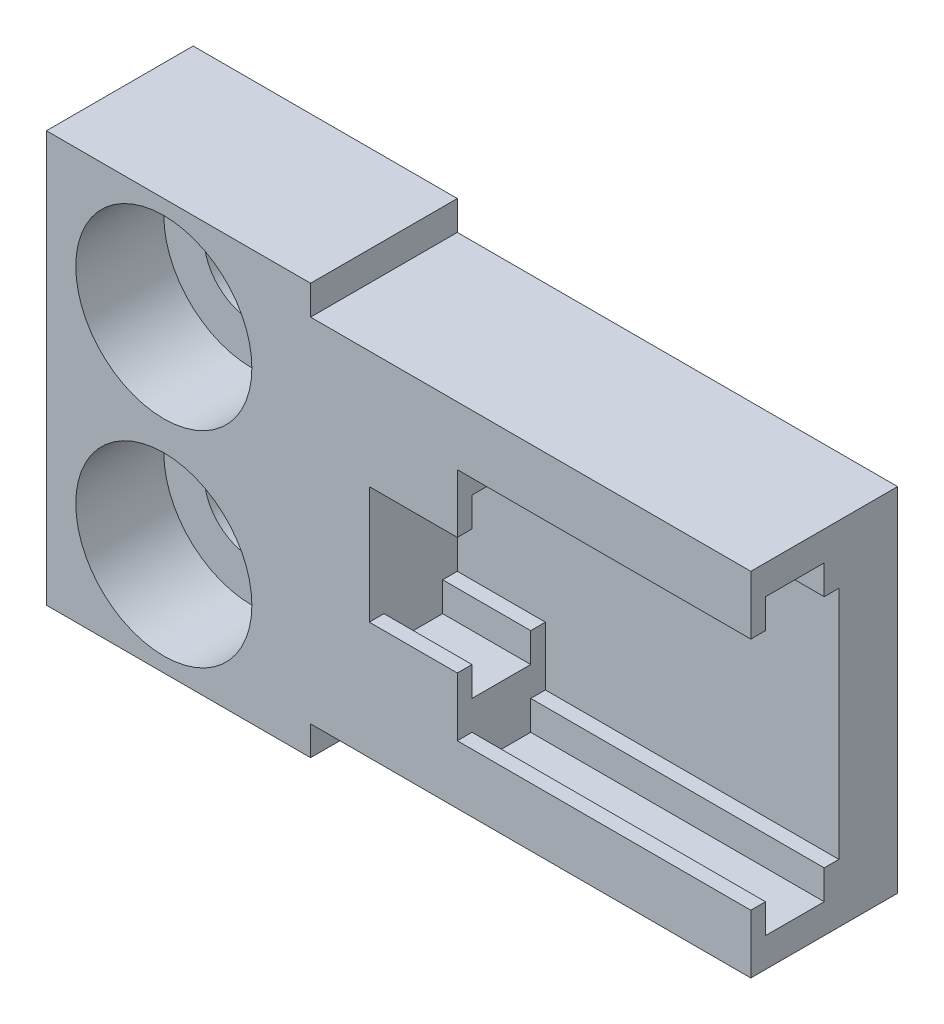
ISO-10303-21;
HEADER;
FILE_DESCRIPTION(('STEP AP214'),'2;1');
FILE_NAME('part.step','',(''),(''),'','','');
FILE_SCHEMA(('AUTOMOTIVE_DESIGN { 1 0 10303 214 1 1 1 1 }'));
ENDSEC;
DATA;
#1=APPLICATION_CONTEXT('core data for automotive mechanical design processes');
#2=APPLICATION_PROTOCOL_DEFINITION('international standard','automotive_design',2000,#1);
#3=PRODUCT_CONTEXT('',#1,'mechanical');
#4=PRODUCT('Part','Part','',(#3));
#5=PRODUCT_RELATED_PRODUCT_CATEGORY('part','',(#4));
#6=PRODUCT_DEFINITION_FORMATION('','',#4);
#7=PRODUCT_DEFINITION_CONTEXT('part definition',#1,'design');
#8=PRODUCT_DEFINITION('design','',#6,#7);
#9=PRODUCT_DEFINITION_SHAPE('','',#8);
#10=(LENGTH_UNIT() NAMED_UNIT(*) SI_UNIT(.MILLI.,.METRE.));
#11=(NAMED_UNIT(*) PLANE_ANGLE_UNIT() SI_UNIT($,.RADIAN.));
#12=(NAMED_UNIT(*) SI_UNIT($,.STERADIAN.) SOLID_ANGLE_UNIT());
#13=UNCERTAINTY_MEASURE_WITH_UNIT(LENGTH_MEASURE(1.E-05),#10,'distance_accuracy_value','');
#14=(GEOMETRIC_REPRESENTATION_CONTEXT(3) GLOBAL_UNCERTAINTY_ASSIGNED_CONTEXT((#13)) GLOBAL_UNIT_ASSIGNED_CONTEXT((#10,
#11,#12)) REPRESENTATION_CONTEXT('',''));
#15=CARTESIAN_POINT('',(0.,0.,0.));
#16=DIRECTION('',(0.,0.,1.));
#17=DIRECTION('',(1.,0.,0.));
#18=AXIS2_PLACEMENT_3D('',#15,#16,#17);
#19=CARTESIAN_POINT('',(-2.5,-2.,2.));
#20=DIRECTION('',(0.,-1.,0.));
#21=DIRECTION('',(1.,0.,0.));
#22=AXIS2_PLACEMENT_3D('',#19,#20,#21);
#23=PLANE('',#22);
#24=DIRECTION('',(0.,0.,1.));
#25=VECTOR('',#24,1.);
#26=CARTESIAN_POINT('',(-5.5,-2.,2.));
#27=LINE('',#26,#25);
#28=CARTESIAN_POINT('',(-5.5,-2.,2.));
#29=VERTEX_POINT('',#28);
#30=CARTESIAN_POINT('',(-5.5,-2.,2.5));
#31=VERTEX_POINT('',#30);
#32=EDGE_CURVE('E284',#29,#31,#27,.T.);
#33=ORIENTED_EDGE('',*,*,#32,.T.);
#34=DIRECTION('',(1.,0.,0.));
#35=VECTOR('',#34,1.);
#36=CARTESIAN_POINT('',(-5.5,-2.,2.5));
#37=LINE('',#36,#35);
#38=CARTESIAN_POINT('',(-2.5,-2.,2.5));
#39=VERTEX_POINT('',#38);
#40=EDGE_CURVE('E543',#31,#39,#37,.T.);
#41=ORIENTED_EDGE('',*,*,#40,.T.);
#42=DIRECTION('',(0.,0.,1.));
#43=VECTOR('',#42,1.);
#44=CARTESIAN_POINT('',(-2.5,-2.,2.));
#45=LINE('',#44,#43);
#46=CARTESIAN_POINT('',(-2.5,-2.,2.));
#47=VERTEX_POINT('',#46);
#48=EDGE_CURVE('E469',#47,#39,#45,.T.);
#49=ORIENTED_EDGE('',*,*,#48,.F.);
#50=DIRECTION('',(1.,0.,0.));
#51=VECTOR('',#50,1.);
#52=CARTESIAN_POINT('',(-2.5,-2.,2.));
#53=LINE('',#52,#51);
#54=EDGE_CURVE('E441',#29,#47,#53,.T.);
#55=ORIENTED_EDGE('',*,*,#54,.F.);
#56=EDGE_LOOP('',(#33,#41,#49,#55));
#57=FACE_BOUND('',#56,.T.);
#58=ADVANCED_FACE('F37',(#57),#23,.F.);
#59=CARTESIAN_POINT('',(-2.5,2.,2.));
#60=DIRECTION('',(0.,1.,0.));
#61=DIRECTION('',(-1.,0.,0.));
#62=AXIS2_PLACEMENT_3D('',#59,#60,#61);
#63=PLANE('',#62);
#64=DIRECTION('',(0.,0.,1.));
#65=VECTOR('',#64,1.);
#66=CARTESIAN_POINT('',(-5.5,2.,2.));
#67=LINE('',#66,#65);
#68=CARTESIAN_POINT('',(-5.5,2.,4.5));
#69=VERTEX_POINT('',#68);
#70=CARTESIAN_POINT('',(-5.5,2.,5.));
#71=VERTEX_POINT('',#70);
#72=EDGE_CURVE('E264',#69,#71,#67,.T.);
#73=ORIENTED_EDGE('',*,*,#72,.F.);
#74=DIRECTION('',(1.,0.,0.));
#75=VECTOR('',#74,1.);
#76=CARTESIAN_POINT('',(-5.5,2.,4.5));
#77=LINE('',#76,#75);
#78=CARTESIAN_POINT('',(-2.5,2.,4.5));
#79=VERTEX_POINT('',#78);
#80=EDGE_CURVE('E250',#69,#79,#77,.T.);
#81=ORIENTED_EDGE('',*,*,#80,.T.);
#82=DIRECTION('',(0.,0.,1.));
#83=VECTOR('',#82,1.);
#84=CARTESIAN_POINT('',(-2.5,2.,2.));
#85=LINE('',#84,#83);
#86=CARTESIAN_POINT('',(-2.5,2.,5.));
#87=VERTEX_POINT('',#86);
#88=EDGE_CURVE('E281',#79,#87,#85,.T.);
#89=ORIENTED_EDGE('',*,*,#88,.T.);
#90=DIRECTION('',(-1.,0.,0.));
#91=VECTOR('',#90,1.);
#92=CARTESIAN_POINT('',(-2.5,2.,5.));
#93=LINE('',#92,#91);
#94=EDGE_CURVE('E273',#87,#71,#93,.T.);
#95=ORIENTED_EDGE('',*,*,#94,.T.);
#96=EDGE_LOOP('',(#73,#81,#89,#95));
#97=FACE_BOUND('',#96,.T.);
#98=ADVANCED_FACE('F271',(#97),#63,.F.);
#99=CARTESIAN_POINT('',(7.5,-4.,2.));
#100=DIRECTION('',(0.,-1.,0.));
#101=DIRECTION('',(1.,0.,0.));
#102=AXIS2_PLACEMENT_3D('',#99,#100,#101);
#103=PLANE('',#102);
#104=DIRECTION('',(0.,0.,1.));
#105=VECTOR('',#104,1.);
#106=CARTESIAN_POINT('',(-2.5,-4.,2.));
#107=LINE('',#106,#105);
#108=CARTESIAN_POINT('',(-2.5,-4.,2.));
#109=VERTEX_POINT('',#108);
#110=CARTESIAN_POINT('',(-2.5,-4.,2.5));
#111=VERTEX_POINT('',#110);
#112=EDGE_CURVE('E466',#109,#111,#107,.T.);
#113=ORIENTED_EDGE('',*,*,#112,.T.);
#114=DIRECTION('',(1.,0.,0.));
#115=VECTOR('',#114,1.);
#116=CARTESIAN_POINT('',(-2.5,-4.,2.5));
#117=LINE('',#116,#115);
#118=CARTESIAN_POINT('',(7.5,-4.,2.5));
#119=VERTEX_POINT('',#118);
#120=EDGE_CURVE('E515',#111,#119,#117,.T.);
#121=ORIENTED_EDGE('',*,*,#120,.T.);
#122=DIRECTION('',(0.,0.,1.));
#123=VECTOR('',#122,1.);
#124=CARTESIAN_POINT('',(7.5,-4.,2.));
#125=LINE('',#124,#123);
#126=CARTESIAN_POINT('',(7.5,-4.,2.));
#127=VERTEX_POINT('',#126);
#128=EDGE_CURVE('E302',#127,#119,#125,.T.);
#129=ORIENTED_EDGE('',*,*,#128,.F.);
#130=DIRECTION('',(1.,0.,0.));
#131=VECTOR('',#130,1.);
#132=CARTESIAN_POINT('',(7.5,-4.,2.));
#133=LINE('',#132,#131);
#134=EDGE_CURVE('E432',#109,#127,#133,.T.);
#135=ORIENTED_EDGE('',*,*,#134,.F.);
#136=EDGE_LOOP('',(#113,#121,#129,#135));
#137=FACE_BOUND('',#136,.T.);
#138=ADVANCED_FACE('F547',(#137),#103,.F.);
#139=CARTESIAN_POINT('',(7.5,4.,2.));
#140=DIRECTION('',(0.,1.,0.));
#141=DIRECTION('',(-1.,0.,0.));
#142=AXIS2_PLACEMENT_3D('',#139,#140,#141);
#143=PLANE('',#142);
#144=DIRECTION('',(0.,0.,1.));
#145=VECTOR('',#144,1.);
#146=CARTESIAN_POINT('',(-2.5,4.,2.));
#147=LINE('',#146,#145);
#148=CARTESIAN_POINT('',(-2.5,4.,4.5));
#149=VERTEX_POINT('',#148);
#150=CARTESIAN_POINT('',(-2.5,4.,5.));
#151=VERTEX_POINT('',#150);
#152=EDGE_CURVE('E290',#149,#151,#147,.T.);
#153=ORIENTED_EDGE('',*,*,#152,.F.);
#154=DIRECTION('',(1.,0.,0.));
#155=VECTOR('',#154,1.);
#156=CARTESIAN_POINT('',(-2.5,4.,4.5));
#157=LINE('',#156,#155);
#158=CARTESIAN_POINT('',(7.5,4.,4.5));
#159=VERTEX_POINT('',#158);
#160=EDGE_CURVE('E511',#149,#159,#157,.T.);
#161=ORIENTED_EDGE('',*,*,#160,.T.);
#162=DIRECTION('',(0.,0.,1.));
#163=VECTOR('',#162,1.);
#164=CARTESIAN_POINT('',(7.5,4.,2.));
#165=LINE('',#164,#163);
#166=CARTESIAN_POINT('',(7.5,4.,5.));
#167=VERTEX_POINT('',#166);
#168=EDGE_CURVE('E294',#159,#167,#165,.T.);
#169=ORIENTED_EDGE('',*,*,#168,.T.);
#170=DIRECTION('',(-1.,0.,0.));
#171=VECTOR('',#170,1.);
#172=CARTESIAN_POINT('',(7.5,4.,5.));
#173=LINE('',#172,#171);
#174=EDGE_CURVE('E426',#167,#151,#173,.T.);
#175=ORIENTED_EDGE('',*,*,#174,.T.);
#176=EDGE_LOOP('',(#153,#161,#169,#175));
#177=FACE_BOUND('',#176,.T.);
#178=ADVANCED_FACE('F616',(#177),#143,.F.);
#179=CARTESIAN_POINT('',(7.5,-6.,5.));
#180=DIRECTION('',(-1.,0.,0.));
#181=DIRECTION('',(0.,0.,1.));
#182=AXIS2_PLACEMENT_3D('',#179,#180,#181);
#183=PLANE('',#182);
#184=ORIENTED_EDGE('',*,*,#168,.F.);
#185=DIRECTION('',(0.,-1.,0.));
#186=VECTOR('',#185,1.);
#187=CARTESIAN_POINT('',(7.5,4.,4.5));
#188=LINE('',#187,#186);
#189=CARTESIAN_POINT('',(7.5,5.,4.5));
#190=VERTEX_POINT('',#189);
#191=EDGE_CURVE('E429',#190,#159,#188,.T.);
#192=ORIENTED_EDGE('',*,*,#191,.F.);
#193=DIRECTION('',(0.,0.,1.));
#194=VECTOR('',#193,1.);
#195=CARTESIAN_POINT('',(7.5,5.,4.5));
#196=LINE('',#195,#194);
#197=CARTESIAN_POINT('',(7.5,5.,2.5));
#198=VERTEX_POINT('',#197);
#199=EDGE_CURVE('E600',#198,#190,#196,.T.);
#200=ORIENTED_EDGE('',*,*,#199,.F.);
#201=DIRECTION('',(0.,1.,0.));
#202=VECTOR('',#201,1.);
#203=CARTESIAN_POINT('',(7.5,4.,2.5));
#204=LINE('',#203,#202);
#205=CARTESIAN_POINT('',(7.5,4.,2.5));
#206=VERTEX_POINT('',#205);
#207=EDGE_CURVE('E606',#206,#198,#204,.T.);
#208=ORIENTED_EDGE('',*,*,#207,.F.);
#209=CARTESIAN_POINT('',(7.5,4.,2.));
#210=VERTEX_POINT('',#209);
#211=EDGE_CURVE('E291',#210,#206,#165,.T.);
#212=ORIENTED_EDGE('',*,*,#211,.F.);
#213=DIRECTION('',(0.,1.,0.));
#214=VECTOR('',#213,1.);
#215=CARTESIAN_POINT('',(7.5,4.,2.));
#216=LINE('',#215,#214);
#217=EDGE_CURVE('E462',#127,#210,#216,.T.);
#218=ORIENTED_EDGE('',*,*,#217,.F.);
#219=ORIENTED_EDGE('',*,*,#128,.T.);
#220=DIRECTION('',(0.,1.,0.));
#221=VECTOR('',#220,1.);
#222=CARTESIAN_POINT('',(7.5,-4.,2.5));
#223=LINE('',#222,#221);
#224=CARTESIAN_POINT('',(7.5,-5.,2.5));
#225=VERTEX_POINT('',#224);
#226=EDGE_CURVE('E519',#225,#119,#223,.T.);
#227=ORIENTED_EDGE('',*,*,#226,.F.);
#228=DIRECTION('',(0.,0.,-1.));
#229=VECTOR('',#228,1.);
#230=CARTESIAN_POINT('',(7.5,-5.,4.5));
#231=LINE('',#230,#229);
#232=CARTESIAN_POINT('',(7.5,-5.,4.5));
#233=VERTEX_POINT('',#232);
#234=EDGE_CURVE('E521',#233,#225,#231,.T.);
#235=ORIENTED_EDGE('',*,*,#234,.F.);
#236=DIRECTION('',(0.,-1.,0.));
#237=VECTOR('',#236,1.);
#238=CARTESIAN_POINT('',(7.5,-4.,4.5));
#239=LINE('',#238,#237);
#240=CARTESIAN_POINT('',(7.5,-4.,4.5));
#241=VERTEX_POINT('',#240);
#242=EDGE_CURVE('E524',#241,#233,#239,.T.);
#243=ORIENTED_EDGE('',*,*,#242,.F.);
#244=CARTESIAN_POINT('',(7.5,-4.,5.));
#245=VERTEX_POINT('',#244);
#246=EDGE_CURVE('E465',#241,#245,#125,.T.);
#247=ORIENTED_EDGE('',*,*,#246,.T.);
#248=DIRECTION('',(0.,1.,0.));
#249=VECTOR('',#248,1.);
#250=CARTESIAN_POINT('',(7.5,-6.,5.));
#251=LINE('',#250,#249);
#252=CARTESIAN_POINT('',(7.5,-6.,5.));
#253=VERTEX_POINT('',#252);
#254=EDGE_CURVE('E351',#253,#245,#251,.T.);
#255=ORIENTED_EDGE('',*,*,#254,.F.);
#256=DIRECTION('',(0.,0.,-1.));
#257=VECTOR('',#256,1.);
#258=CARTESIAN_POINT('',(7.5,-6.,5.));
#259=LINE('',#258,#257);
#260=CARTESIAN_POINT('',(7.5,-6.,0.));
#261=VERTEX_POINT('',#260);
#262=EDGE_CURVE('E359',#253,#261,#259,.T.);
#263=ORIENTED_EDGE('',*,*,#262,.T.);
#264=DIRECTION('',(0.,1.,0.));
#265=VECTOR('',#264,1.);
#266=CARTESIAN_POINT('',(7.5,-6.,0.));
#267=LINE('',#266,#265);
#268=CARTESIAN_POINT('',(7.5,6.,0.));
#269=VERTEX_POINT('',#268);
#270=EDGE_CURVE('E344',#261,#269,#267,.T.);
#271=ORIENTED_EDGE('',*,*,#270,.T.);
#272=DIRECTION('',(0.,0.,-1.));
#273=VECTOR('',#272,1.);
#274=CARTESIAN_POINT('',(7.5,6.,5.));
#275=LINE('',#274,#273);
#276=CARTESIAN_POINT('',(7.5,6.,5.));
#277=VERTEX_POINT('',#276);
#278=EDGE_CURVE('E11',#277,#269,#275,.T.);
#279=ORIENTED_EDGE('',*,*,#278,.F.);
#280=EDGE_CURVE('E355',#167,#277,#251,.T.);
#281=ORIENTED_EDGE('',*,*,#280,.F.);
#282=EDGE_LOOP('',(#184,#192,#200,#208,#212,#218,#219,#227,#235,#243,#247,#255,#263,#271,#279,#281));
#283=FACE_BOUND('',#282,.T.);
#284=ADVANCED_FACE('F39',(#283),#183,.F.);
#285=CARTESIAN_POINT('',(-7.5,6.,5.));
#286=DIRECTION('',(0.,-1.,0.));
#287=DIRECTION('',(0.,0.,-1.));
#288=AXIS2_PLACEMENT_3D('',#285,#286,#287);
#289=PLANE('',#288);
#290=DIRECTION('',(-1.,0.,0.));
#291=VECTOR('',#290,1.);
#292=CARTESIAN_POINT('',(-7.5,6.,0.));
#293=LINE('',#292,#291);
#294=CARTESIAN_POINT('',(-7.5,6.,0.));
#295=VERTEX_POINT('',#294);
#296=EDGE_CURVE('E362',#269,#295,#293,.T.);
#297=ORIENTED_EDGE('',*,*,#296,.T.);
#298=DIRECTION('',(0.,0.,-1.));
#299=VECTOR('',#298,1.);
#300=CARTESIAN_POINT('',(-7.5,6.,5.));
#301=LINE('',#300,#299);
#302=CARTESIAN_POINT('',(-7.5,6.,5.));
#303=VERTEX_POINT('',#302);
#304=EDGE_CURVE('E46',#303,#295,#301,.T.);
#305=ORIENTED_EDGE('',*,*,#304,.F.);
#306=DIRECTION('',(-1.,0.,0.));
#307=VECTOR('',#306,1.);
#308=CARTESIAN_POINT('',(-7.5,6.,5.));
#309=LINE('',#308,#307);
#310=EDGE_CURVE('E354',#277,#303,#309,.T.);
#311=ORIENTED_EDGE('',*,*,#310,.F.);
#312=ORIENTED_EDGE('',*,*,#278,.T.);
#313=EDGE_LOOP('',(#297,#305,#311,#312));
#314=FACE_BOUND('',#313,.T.);
#315=ADVANCED_FACE('F422',(#314),#289,.F.);
#316=CARTESIAN_POINT('',(-7.5,-6.,5.));
#317=DIRECTION('',(0.,1.,0.));
#318=DIRECTION('',(0.,0.,1.));
#319=AXIS2_PLACEMENT_3D('',#316,#317,#318);
#320=PLANE('',#319);
#321=DIRECTION('',(1.,0.,0.));
#322=VECTOR('',#321,1.);
#323=CARTESIAN_POINT('',(-7.5,-6.,0.));
#324=LINE('',#323,#322);
#325=CARTESIAN_POINT('',(-7.5,-6.,0.));
#326=VERTEX_POINT('',#325);
#327=EDGE_CURVE('E364',#326,#261,#324,.T.);
#328=ORIENTED_EDGE('',*,*,#327,.T.);
#329=ORIENTED_EDGE('',*,*,#262,.F.);
#330=DIRECTION('',(1.,0.,0.));
#331=VECTOR('',#330,1.);
#332=CARTESIAN_POINT('',(-7.5,-6.,5.));
#333=LINE('',#332,#331);
#334=CARTESIAN_POINT('',(-7.5,-6.,5.));
#335=VERTEX_POINT('',#334);
#336=EDGE_CURVE('E357',#335,#253,#333,.T.);
#337=ORIENTED_EDGE('',*,*,#336,.F.);
#338=DIRECTION('',(0.,0.,-1.));
#339=VECTOR('',#338,1.);
#340=CARTESIAN_POINT('',(-7.5,-6.,5.));
#341=LINE('',#340,#339);
#342=EDGE_CURVE('E368',#335,#326,#341,.T.);
#343=ORIENTED_EDGE('',*,*,#342,.T.);
#344=EDGE_LOOP('',(#328,#329,#337,#343));
#345=FACE_BOUND('',#344,.T.);
#346=ADVANCED_FACE('F397',(#345),#320,.F.);
#347=CARTESIAN_POINT('',(0.,0.,5.));
#348=DIRECTION('',(0.,0.,-1.));
#349=DIRECTION('',(-1.,0.,0.));
#350=AXIS2_PLACEMENT_3D('',#347,#348,#349);
#351=PLANE('',#350);
#352=CARTESIAN_POINT('',(-12.5002300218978,-3.50000000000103,5.));
#353=DIRECTION('',(0.,0.,1.));
#354=DIRECTION('',(1.,0.,0.));
#355=AXIS2_PLACEMENT_3D('',#352,#353,#354);
#356=CIRCLE('',#355,3.);
#357=CARTESIAN_POINT('',(-9.5002300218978,-3.50000000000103,5.));
#358=VERTEX_POINT('',#357);
#359=EDGE_CURVE('E307',#358,#358,#356,.T.);
#360=ORIENTED_EDGE('',*,*,#359,.F.);
#361=EDGE_LOOP('',(#360));
#362=FACE_BOUND('',#361,.T.);
#363=CARTESIAN_POINT('',(-12.5002300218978,3.5,5.));
#364=DIRECTION('',(0.,0.,1.));
#365=DIRECTION('',(1.,0.,0.));
#366=AXIS2_PLACEMENT_3D('',#363,#364,#365);
#367=CIRCLE('',#366,3.);
#368=CARTESIAN_POINT('',(-9.5002300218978,3.5,5.));
#369=VERTEX_POINT('',#368);
#370=EDGE_CURVE('E310',#369,#369,#367,.T.);
#371=ORIENTED_EDGE('',*,*,#370,.F.);
#372=EDGE_LOOP('',(#371));
#373=FACE_BOUND('',#372,.T.);
#374=ORIENTED_EDGE('',*,*,#254,.T.);
#375=DIRECTION('',(1.,0.,0.));
#376=VECTOR('',#375,1.);
#377=CARTESIAN_POINT('',(7.5,-4.,5.));
#378=LINE('',#377,#376);
#379=CARTESIAN_POINT('',(-2.5,-4.,5.));
#380=VERTEX_POINT('',#379);
#381=EDGE_CURVE('E459',#380,#245,#378,.T.);
#382=ORIENTED_EDGE('',*,*,#381,.F.);
#383=DIRECTION('',(0.,-1.,0.));
#384=VECTOR('',#383,1.);
#385=CARTESIAN_POINT('',(-2.5,-2.,5.));
#386=LINE('',#385,#384);
#387=CARTESIAN_POINT('',(-2.5,-2.,5.));
#388=VERTEX_POINT('',#387);
#389=EDGE_CURVE('E456',#388,#380,#386,.T.);
#390=ORIENTED_EDGE('',*,*,#389,.F.);
#391=DIRECTION('',(1.,0.,0.));
#392=VECTOR('',#391,1.);
#393=CARTESIAN_POINT('',(-2.5,-2.,5.));
#394=LINE('',#393,#392);
#395=CARTESIAN_POINT('',(-5.5,-2.,5.));
#396=VERTEX_POINT('',#395);
#397=EDGE_CURVE('E453',#396,#388,#394,.T.);
#398=ORIENTED_EDGE('',*,*,#397,.F.);
#399=DIRECTION('',(0.,-1.,0.));
#400=VECTOR('',#399,1.);
#401=CARTESIAN_POINT('',(-5.5,2.,5.));
#402=LINE('',#401,#400);
#403=EDGE_CURVE('E451',#71,#396,#402,.T.);
#404=ORIENTED_EDGE('',*,*,#403,.F.);
#405=ORIENTED_EDGE('',*,*,#94,.F.);
#406=DIRECTION('',(0.,-1.,0.));
#407=VECTOR('',#406,1.);
#408=CARTESIAN_POINT('',(-2.5,4.,5.));
#409=LINE('',#408,#407);
#410=EDGE_CURVE('E446',#151,#87,#409,.T.);
#411=ORIENTED_EDGE('',*,*,#410,.F.);
#412=ORIENTED_EDGE('',*,*,#174,.F.);
#413=ORIENTED_EDGE('',*,*,#280,.T.);
#414=ORIENTED_EDGE('',*,*,#310,.T.);
#415=DIRECTION('',(0.,-1.,0.));
#416=VECTOR('',#415,1.);
#417=CARTESIAN_POINT('',(-7.5,6.,5.));
#418=LINE('',#417,#416);
#419=CARTESIAN_POINT('',(-7.5,7.,5.));
#420=VERTEX_POINT('',#419);
#421=EDGE_CURVE('E316',#420,#303,#418,.T.);
#422=ORIENTED_EDGE('',*,*,#421,.F.);
#423=DIRECTION('',(1.,0.,0.));
#424=VECTOR('',#423,1.);
#425=CARTESIAN_POINT('',(-16.5,7.,5.));
#426=LINE('',#425,#424);
#427=CARTESIAN_POINT('',(-16.5,7.,5.));
#428=VERTEX_POINT('',#427);
#429=EDGE_CURVE('E326',#428,#420,#426,.T.);
#430=ORIENTED_EDGE('',*,*,#429,.F.);
#431=DIRECTION('',(0.,1.,0.));
#432=VECTOR('',#431,1.);
#433=CARTESIAN_POINT('',(-16.5,-7.,5.));
#434=LINE('',#433,#432);
#435=CARTESIAN_POINT('',(-16.5,-7.,5.));
#436=VERTEX_POINT('',#435);
#437=EDGE_CURVE('E323',#436,#428,#434,.T.);
#438=ORIENTED_EDGE('',*,*,#437,.F.);
#439=DIRECTION('',(-1.,0.,0.));
#440=VECTOR('',#439,1.);
#441=CARTESIAN_POINT('',(-7.5,-7.,5.));
#442=LINE('',#441,#440);
#443=CARTESIAN_POINT('',(-7.5,-7.,5.));
#444=VERTEX_POINT('',#443);
#445=EDGE_CURVE('E319',#444,#436,#442,.T.);
#446=ORIENTED_EDGE('',*,*,#445,.F.);
#447=EDGE_CURVE('E320',#335,#444,#418,.T.);
#448=ORIENTED_EDGE('',*,*,#447,.F.);
#449=ORIENTED_EDGE('',*,*,#336,.T.);
#450=EDGE_LOOP('',(#374,#382,#390,#398,#404,#405,#411,#412,#413,#414,#422,#430,#438,#446,#448,#449));
#451=FACE_BOUND('',#450,.T.);
#452=ADVANCED_FACE('F384',(#362,#373,#451),#351,.F.);
#453=CARTESIAN_POINT('',(0.,0.,0.));
#454=DIRECTION('',(0.,0.,-1.));
#455=DIRECTION('',(-1.,0.,0.));
#456=AXIS2_PLACEMENT_3D('',#453,#454,#455);
#457=PLANE('',#456);
#458=CARTESIAN_POINT('',(-12.5002300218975,-3.49999999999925,0.));
#459=DIRECTION('',(0.,0.,-1.));
#460=DIRECTION('',(-1.,0.,0.));
#461=AXIS2_PLACEMENT_3D('',#458,#459,#460);
#462=CIRCLE('',#461,1.625);
#463=CARTESIAN_POINT('',(-14.1252300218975,-3.49999999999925,0.));
#464=VERTEX_POINT('',#463);
#465=EDGE_CURVE('E41',#464,#464,#462,.T.);
#466=ORIENTED_EDGE('',*,*,#465,.F.);
#467=EDGE_LOOP('',(#466));
#468=FACE_BOUND('',#467,.T.);
#469=CARTESIAN_POINT('',(-12.5002300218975,3.5,0.));
#470=DIRECTION('',(0.,0.,-1.));
#471=DIRECTION('',(-1.,0.,0.));
#472=AXIS2_PLACEMENT_3D('',#469,#470,#471);
#473=CIRCLE('',#472,1.625);
#474=CARTESIAN_POINT('',(-14.1252300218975,3.5,0.));
#475=VERTEX_POINT('',#474);
#476=EDGE_CURVE('E298',#475,#475,#473,.T.);
#477=ORIENTED_EDGE('',*,*,#476,.F.);
#478=EDGE_LOOP('',(#477));
#479=FACE_BOUND('',#478,.T.);
#480=ORIENTED_EDGE('',*,*,#270,.F.);
#481=ORIENTED_EDGE('',*,*,#327,.F.);
#482=DIRECTION('',(0.,-1.,0.));
#483=VECTOR('',#482,1.);
#484=CARTESIAN_POINT('',(-7.5,7.,0.));
#485=LINE('',#484,#483);
#486=CARTESIAN_POINT('',(-7.5,-7.,0.));
#487=VERTEX_POINT('',#486);
#488=EDGE_CURVE('E338',#326,#487,#485,.T.);
#489=ORIENTED_EDGE('',*,*,#488,.T.);
#490=DIRECTION('',(-1.,0.,0.));
#491=VECTOR('',#490,1.);
#492=CARTESIAN_POINT('',(-7.5,-7.,0.));
#493=LINE('',#492,#491);
#494=CARTESIAN_POINT('',(-16.5,-7.,0.));
#495=VERTEX_POINT('',#494);
#496=EDGE_CURVE('E306',#487,#495,#493,.T.);
#497=ORIENTED_EDGE('',*,*,#496,.T.);
#498=DIRECTION('',(0.,1.,0.));
#499=VECTOR('',#498,1.);
#500=CARTESIAN_POINT('',(-16.5,-7.,0.));
#501=LINE('',#500,#499);
#502=CARTESIAN_POINT('',(-16.5,7.,0.));
#503=VERTEX_POINT('',#502);
#504=EDGE_CURVE('E332',#495,#503,#501,.T.);
#505=ORIENTED_EDGE('',*,*,#504,.T.);
#506=DIRECTION('',(1.,0.,0.));
#507=VECTOR('',#506,1.);
#508=CARTESIAN_POINT('',(-16.5,7.,0.));
#509=LINE('',#508,#507);
#510=CARTESIAN_POINT('',(-7.5,7.,0.));
#511=VERTEX_POINT('',#510);
#512=EDGE_CURVE('E335',#503,#511,#509,.T.);
#513=ORIENTED_EDGE('',*,*,#512,.T.);
#514=EDGE_CURVE('E339',#511,#295,#485,.T.);
#515=ORIENTED_EDGE('',*,*,#514,.T.);
#516=ORIENTED_EDGE('',*,*,#296,.F.);
#517=EDGE_LOOP('',(#480,#481,#489,#497,#505,#513,#515,#516));
#518=FACE_BOUND('',#517,.T.);
#519=ADVANCED_FACE('F380',(#468,#479,#518),#457,.T.);
#520=CARTESIAN_POINT('',(-7.5,7.,5.));
#521=DIRECTION('',(1.,0.,0.));
#522=DIRECTION('',(0.,0.,-1.));
#523=AXIS2_PLACEMENT_3D('',#520,#521,#522);
#524=PLANE('',#523);
#525=ORIENTED_EDGE('',*,*,#342,.F.);
#526=ORIENTED_EDGE('',*,*,#447,.T.);
#527=DIRECTION('',(0.,0.,-1.));
#528=VECTOR('',#527,1.);
#529=CARTESIAN_POINT('',(-7.5,-7.,5.));
#530=LINE('',#529,#528);
#531=EDGE_CURVE('E329',#444,#487,#530,.T.);
#532=ORIENTED_EDGE('',*,*,#531,.T.);
#533=ORIENTED_EDGE('',*,*,#488,.F.);
#534=EDGE_LOOP('',(#525,#526,#532,#533));
#535=FACE_BOUND('',#534,.T.);
#536=ADVANCED_FACE('F383',(#535),#524,.T.);
#537=ORIENTED_EDGE('',*,*,#421,.T.);
#538=ORIENTED_EDGE('',*,*,#304,.T.);
#539=ORIENTED_EDGE('',*,*,#514,.F.);
#540=DIRECTION('',(0.,0.,-1.));
#541=VECTOR('',#540,1.);
#542=CARTESIAN_POINT('',(-7.5,7.,5.));
#543=LINE('',#542,#541);
#544=EDGE_CURVE('E342',#420,#511,#543,.T.);
#545=ORIENTED_EDGE('',*,*,#544,.F.);
#546=EDGE_LOOP('',(#537,#538,#539,#545));
#547=FACE_BOUND('',#546,.T.);
#548=ADVANCED_FACE('F418',(#547),#524,.T.);
#549=CARTESIAN_POINT('',(-16.5,7.,5.));
#550=DIRECTION('',(0.,1.,0.));
#551=DIRECTION('',(-1.,0.,0.));
#552=AXIS2_PLACEMENT_3D('',#549,#550,#551);
#553=PLANE('',#552);
#554=ORIENTED_EDGE('',*,*,#512,.F.);
#555=DIRECTION('',(0.,0.,-1.));
#556=VECTOR('',#555,1.);
#557=CARTESIAN_POINT('',(-16.5,7.,5.));
#558=LINE('',#557,#556);
#559=EDGE_CURVE('E345',#428,#503,#558,.T.);
#560=ORIENTED_EDGE('',*,*,#559,.F.);
#561=ORIENTED_EDGE('',*,*,#429,.T.);
#562=ORIENTED_EDGE('',*,*,#544,.T.);
#563=EDGE_LOOP('',(#554,#560,#561,#562));
#564=FACE_BOUND('',#563,.T.);
#565=ADVANCED_FACE('F415',(#564),#553,.T.);
#566=CARTESIAN_POINT('',(-16.5,-7.,5.));
#567=DIRECTION('',(-1.,0.,0.));
#568=DIRECTION('',(0.,0.,1.));
#569=AXIS2_PLACEMENT_3D('',#566,#567,#568);
#570=PLANE('',#569);
#571=ORIENTED_EDGE('',*,*,#504,.F.);
#572=DIRECTION('',(0.,0.,-1.));
#573=VECTOR('',#572,1.);
#574=CARTESIAN_POINT('',(-16.5,-7.,5.));
#575=LINE('',#574,#573);
#576=EDGE_CURVE('E347',#436,#495,#575,.T.);
#577=ORIENTED_EDGE('',*,*,#576,.F.);
#578=ORIENTED_EDGE('',*,*,#437,.T.);
#579=ORIENTED_EDGE('',*,*,#559,.T.);
#580=EDGE_LOOP('',(#571,#577,#578,#579));
#581=FACE_BOUND('',#580,.T.);
#582=ADVANCED_FACE('F413',(#581),#570,.T.);
#583=CARTESIAN_POINT('',(-7.5,-7.,5.));
#584=DIRECTION('',(0.,-1.,0.));
#585=DIRECTION('',(0.,0.,-1.));
#586=AXIS2_PLACEMENT_3D('',#583,#584,#585);
#587=PLANE('',#586);
#588=ORIENTED_EDGE('',*,*,#496,.F.);
#589=ORIENTED_EDGE('',*,*,#531,.F.);
#590=ORIENTED_EDGE('',*,*,#445,.T.);
#591=ORIENTED_EDGE('',*,*,#576,.T.);
#592=EDGE_LOOP('',(#588,#589,#590,#591));
#593=FACE_BOUND('',#592,.T.);
#594=ADVANCED_FACE('F408',(#593),#587,.T.);
#595=CARTESIAN_POINT('',(-12.5002300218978,3.5,2.));
#596=DIRECTION('',(0.,0.,1.));
#597=DIRECTION('',(1.,0.,0.));
#598=AXIS2_PLACEMENT_3D('',#595,#596,#597);
#599=CYLINDRICAL_SURFACE('',#598,3.);
#600=CARTESIAN_POINT('',(-12.5002300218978,3.5,2.));
#601=DIRECTION('',(0.,0.,1.));
#602=DIRECTION('',(1.,0.,0.));
#603=AXIS2_PLACEMENT_3D('',#600,#601,#602);
#604=CIRCLE('',#603,3.);
#605=CARTESIAN_POINT('',(-9.5002300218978,3.5,2.));
#606=VERTEX_POINT('',#605);
#607=EDGE_CURVE('E313',#606,#606,#604,.T.);
#608=ORIENTED_EDGE('',*,*,#607,.F.);
#609=EDGE_LOOP('',(#608));
#610=FACE_BOUND('',#609,.T.);
#611=ORIENTED_EDGE('',*,*,#370,.T.);
#612=EDGE_LOOP('',(#611));
#613=FACE_BOUND('',#612,.T.);
#614=ADVANCED_FACE('F912',(#610,#613),#599,.F.);
#615=CARTESIAN_POINT('',(-12.5002300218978,3.5,2.));
#616=DIRECTION('',(0.,0.,1.));
#617=DIRECTION('',(1.,0.,0.));
#618=AXIS2_PLACEMENT_3D('',#615,#616,#617);
#619=PLANE('',#618);
#620=CARTESIAN_POINT('',(-12.5002300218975,3.5,2.));
#621=DIRECTION('',(0.,0.,1.));
#622=DIRECTION('',(1.,0.,0.));
#623=AXIS2_PLACEMENT_3D('',#620,#621,#622);
#624=CIRCLE('',#623,1.625);
#625=CARTESIAN_POINT('',(-10.8752300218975,3.5,2.));
#626=VERTEX_POINT('',#625);
#627=EDGE_CURVE('E299',#626,#626,#624,.T.);
#628=ORIENTED_EDGE('',*,*,#627,.F.);
#629=EDGE_LOOP('',(#628));
#630=FACE_BOUND('',#629,.T.);
#631=ORIENTED_EDGE('',*,*,#607,.T.);
#632=EDGE_LOOP('',(#631));
#633=FACE_BOUND('',#632,.T.);
#634=ADVANCED_FACE('F907',(#630,#633),#619,.T.);
#635=CARTESIAN_POINT('',(-12.5002300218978,-3.50000000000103,2.));
#636=DIRECTION('',(0.,0.,1.));
#637=DIRECTION('',(1.,0.,0.));
#638=AXIS2_PLACEMENT_3D('',#635,#636,#637);
#639=CYLINDRICAL_SURFACE('',#638,3.);
#640=CARTESIAN_POINT('',(-12.5002300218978,-3.50000000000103,2.));
#641=DIRECTION('',(0.,0.,1.));
#642=DIRECTION('',(1.,0.,0.));
#643=AXIS2_PLACEMENT_3D('',#640,#641,#642);
#644=CIRCLE('',#643,3.);
#645=CARTESIAN_POINT('',(-9.5002300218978,-3.50000000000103,2.));
#646=VERTEX_POINT('',#645);
#647=EDGE_CURVE('E303',#646,#646,#644,.T.);
#648=ORIENTED_EDGE('',*,*,#647,.F.);
#649=EDGE_LOOP('',(#648));
#650=FACE_BOUND('',#649,.T.);
#651=ORIENTED_EDGE('',*,*,#359,.T.);
#652=EDGE_LOOP('',(#651));
#653=FACE_BOUND('',#652,.T.);
#654=ADVANCED_FACE('F898',(#650,#653),#639,.F.);
#655=CARTESIAN_POINT('',(-12.5002300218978,-3.50000000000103,2.));
#656=DIRECTION('',(0.,0.,1.));
#657=DIRECTION('',(1.,0.,0.));
#658=AXIS2_PLACEMENT_3D('',#655,#656,#657);
#659=PLANE('',#658);
#660=CARTESIAN_POINT('',(-12.5002300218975,-3.49999999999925,2.));
#661=DIRECTION('',(0.,0.,1.));
#662=DIRECTION('',(1.,0.,0.));
#663=AXIS2_PLACEMENT_3D('',#660,#661,#662);
#664=CIRCLE('',#663,1.625);
#665=CARTESIAN_POINT('',(-10.8752300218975,-3.49999999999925,2.));
#666=VERTEX_POINT('',#665);
#667=EDGE_CURVE('E295',#666,#666,#664,.T.);
#668=ORIENTED_EDGE('',*,*,#667,.F.);
#669=EDGE_LOOP('',(#668));
#670=FACE_BOUND('',#669,.T.);
#671=ORIENTED_EDGE('',*,*,#647,.T.);
#672=EDGE_LOOP('',(#671));
#673=FACE_BOUND('',#672,.T.);
#674=ADVANCED_FACE('F888',(#670,#673),#659,.T.);
#675=CARTESIAN_POINT('',(-12.5002300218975,3.5,-2.));
#676=DIRECTION('',(0.,0.,1.));
#677=DIRECTION('',(1.,0.,0.));
#678=AXIS2_PLACEMENT_3D('',#675,#676,#677);
#679=CYLINDRICAL_SURFACE('',#678,1.625);
#680=ORIENTED_EDGE('',*,*,#476,.T.);
#681=EDGE_LOOP('',(#680));
#682=FACE_BOUND('',#681,.T.);
#683=ORIENTED_EDGE('',*,*,#627,.T.);
#684=EDGE_LOOP('',(#683));
#685=FACE_BOUND('',#684,.T.);
#686=ADVANCED_FACE('F878',(#682,#685),#679,.F.);
#687=CARTESIAN_POINT('',(-12.5002300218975,-3.49999999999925,-2.));
#688=DIRECTION('',(0.,0.,1.));
#689=DIRECTION('',(1.,0.,0.));
#690=AXIS2_PLACEMENT_3D('',#687,#688,#689);
#691=CYLINDRICAL_SURFACE('',#690,1.625);
#692=ORIENTED_EDGE('',*,*,#465,.T.);
#693=EDGE_LOOP('',(#692));
#694=FACE_BOUND('',#693,.T.);
#695=ORIENTED_EDGE('',*,*,#667,.T.);
#696=EDGE_LOOP('',(#695));
#697=FACE_BOUND('',#696,.T.);
#698=ADVANCED_FACE('F377',(#694,#697),#691,.F.);
#699=ORIENTED_EDGE('',*,*,#246,.F.);
#700=DIRECTION('',(1.,0.,0.));
#701=VECTOR('',#700,1.);
#702=CARTESIAN_POINT('',(-2.5,-4.,4.5));
#703=LINE('',#702,#701);
#704=CARTESIAN_POINT('',(-2.5,-4.,4.5));
#705=VERTEX_POINT('',#704);
#706=EDGE_CURVE('E499',#705,#241,#703,.T.);
#707=ORIENTED_EDGE('',*,*,#706,.F.);
#708=EDGE_CURVE('E468',#705,#380,#107,.T.);
#709=ORIENTED_EDGE('',*,*,#708,.T.);
#710=ORIENTED_EDGE('',*,*,#381,.T.);
#711=EDGE_LOOP('',(#699,#707,#709,#710));
#712=FACE_BOUND('',#711,.T.);
#713=ADVANCED_FACE('F498',(#712),#103,.F.);
#714=CARTESIAN_POINT('',(-2.5,-2.,2.));
#715=DIRECTION('',(-1.,0.,0.));
#716=DIRECTION('',(0.,-1.,0.));
#717=AXIS2_PLACEMENT_3D('',#714,#715,#716);
#718=PLANE('',#717);
#719=ORIENTED_EDGE('',*,*,#48,.T.);
#720=DIRECTION('',(0.,1.,0.));
#721=VECTOR('',#720,1.);
#722=CARTESIAN_POINT('',(-2.5,-2.,2.5));
#723=LINE('',#722,#721);
#724=CARTESIAN_POINT('',(-2.5,-3.,2.5));
#725=VERTEX_POINT('',#724);
#726=EDGE_CURVE('E585',#725,#39,#723,.T.);
#727=ORIENTED_EDGE('',*,*,#726,.F.);
#728=DIRECTION('',(0.,0.,-1.));
#729=VECTOR('',#728,1.);
#730=CARTESIAN_POINT('',(-2.5,-3.,4.5));
#731=LINE('',#730,#729);
#732=CARTESIAN_POINT('',(-2.5,-3.,4.5));
#733=VERTEX_POINT('',#732);
#734=EDGE_CURVE('E587',#733,#725,#731,.T.);
#735=ORIENTED_EDGE('',*,*,#734,.F.);
#736=DIRECTION('',(0.,-1.,0.));
#737=VECTOR('',#736,1.);
#738=CARTESIAN_POINT('',(-2.5,-2.,4.5));
#739=LINE('',#738,#737);
#740=CARTESIAN_POINT('',(-2.5,-2.,4.5));
#741=VERTEX_POINT('',#740);
#742=EDGE_CURVE('E573',#741,#733,#739,.T.);
#743=ORIENTED_EDGE('',*,*,#742,.F.);
#744=EDGE_CURVE('E471',#741,#388,#45,.T.);
#745=ORIENTED_EDGE('',*,*,#744,.T.);
#746=ORIENTED_EDGE('',*,*,#389,.T.);
#747=ORIENTED_EDGE('',*,*,#708,.F.);
#748=DIRECTION('',(0.,-1.,0.));
#749=VECTOR('',#748,1.);
#750=CARTESIAN_POINT('',(-2.5,-4.,4.5));
#751=LINE('',#750,#749);
#752=CARTESIAN_POINT('',(-2.5,-5.,4.5));
#753=VERTEX_POINT('',#752);
#754=EDGE_CURVE('E494',#705,#753,#751,.T.);
#755=ORIENTED_EDGE('',*,*,#754,.T.);
#756=DIRECTION('',(0.,0.,-1.));
#757=VECTOR('',#756,1.);
#758=CARTESIAN_POINT('',(-2.5,-5.,4.5));
#759=LINE('',#758,#757);
#760=CARTESIAN_POINT('',(-2.5,-5.,2.5));
#761=VERTEX_POINT('',#760);
#762=EDGE_CURVE('E506',#753,#761,#759,.T.);
#763=ORIENTED_EDGE('',*,*,#762,.T.);
#764=DIRECTION('',(0.,1.,0.));
#765=VECTOR('',#764,1.);
#766=CARTESIAN_POINT('',(-2.5,-4.,2.5));
#767=LINE('',#766,#765);
#768=EDGE_CURVE('E503',#761,#111,#767,.T.);
#769=ORIENTED_EDGE('',*,*,#768,.T.);
#770=ORIENTED_EDGE('',*,*,#112,.F.);
#771=DIRECTION('',(0.,-1.,0.));
#772=VECTOR('',#771,1.);
#773=CARTESIAN_POINT('',(-2.5,-2.,2.));
#774=LINE('',#773,#772);
#775=EDGE_CURVE('E434',#47,#109,#774,.T.);
#776=ORIENTED_EDGE('',*,*,#775,.F.);
#777=EDGE_LOOP('',(#719,#727,#735,#743,#745,#746,#747,#755,#763,#769,#770,#776));
#778=FACE_BOUND('',#777,.T.);
#779=ADVANCED_FACE('F491',(#778),#718,.F.);
#780=ORIENTED_EDGE('',*,*,#744,.F.);
#781=DIRECTION('',(1.,0.,0.));
#782=VECTOR('',#781,1.);
#783=CARTESIAN_POINT('',(-5.5,-2.,4.5));
#784=LINE('',#783,#782);
#785=CARTESIAN_POINT('',(-5.5,-2.,4.5));
#786=VERTEX_POINT('',#785);
#787=EDGE_CURVE('E487',#786,#741,#784,.T.);
#788=ORIENTED_EDGE('',*,*,#787,.F.);
#789=EDGE_CURVE('E279',#786,#396,#27,.T.);
#790=ORIENTED_EDGE('',*,*,#789,.T.);
#791=ORIENTED_EDGE('',*,*,#397,.T.);
#792=EDGE_LOOP('',(#780,#788,#790,#791));
#793=FACE_BOUND('',#792,.T.);
#794=ADVANCED_FACE('F484',(#793),#23,.F.);
#795=CARTESIAN_POINT('',(-5.5,2.,2.));
#796=DIRECTION('',(-1.,0.,0.));
#797=DIRECTION('',(0.,-1.,0.));
#798=AXIS2_PLACEMENT_3D('',#795,#796,#797);
#799=PLANE('',#798);
#800=ORIENTED_EDGE('',*,*,#403,.T.);
#801=ORIENTED_EDGE('',*,*,#789,.F.);
#802=DIRECTION('',(0.,-1.,0.));
#803=VECTOR('',#802,1.);
#804=CARTESIAN_POINT('',(-5.5,-2.,4.5));
#805=LINE('',#804,#803);
#806=CARTESIAN_POINT('',(-5.5,-3.,4.5));
#807=VERTEX_POINT('',#806);
#808=EDGE_CURVE('E588',#786,#807,#805,.T.);
#809=ORIENTED_EDGE('',*,*,#808,.T.);
#810=DIRECTION('',(0.,0.,-1.));
#811=VECTOR('',#810,1.);
#812=CARTESIAN_POINT('',(-5.5,-3.,4.5));
#813=LINE('',#812,#811);
#814=CARTESIAN_POINT('',(-5.5,-3.,2.5));
#815=VERTEX_POINT('',#814);
#816=EDGE_CURVE('E594',#807,#815,#813,.T.);
#817=ORIENTED_EDGE('',*,*,#816,.T.);
#818=DIRECTION('',(0.,1.,0.));
#819=VECTOR('',#818,1.);
#820=CARTESIAN_POINT('',(-5.5,-2.,2.5));
#821=LINE('',#820,#819);
#822=EDGE_CURVE('E54',#815,#31,#821,.T.);
#823=ORIENTED_EDGE('',*,*,#822,.T.);
#824=ORIENTED_EDGE('',*,*,#32,.F.);
#825=DIRECTION('',(0.,-1.,0.));
#826=VECTOR('',#825,1.);
#827=CARTESIAN_POINT('',(-5.5,2.,2.));
#828=LINE('',#827,#826);
#829=CARTESIAN_POINT('',(-5.5,2.,2.));
#830=VERTEX_POINT('',#829);
#831=EDGE_CURVE('E538',#830,#29,#828,.T.);
#832=ORIENTED_EDGE('',*,*,#831,.F.);
#833=CARTESIAN_POINT('',(-5.5,2.,2.5));
#834=VERTEX_POINT('',#833);
#835=EDGE_CURVE('E275',#830,#834,#67,.T.);
#836=ORIENTED_EDGE('',*,*,#835,.T.);
#837=DIRECTION('',(0.,1.,0.));
#838=VECTOR('',#837,1.);
#839=CARTESIAN_POINT('',(-5.5,2.,2.5));
#840=LINE('',#839,#838);
#841=CARTESIAN_POINT('',(-5.5,3.,2.5));
#842=VERTEX_POINT('',#841);
#843=EDGE_CURVE('E268',#834,#842,#840,.T.);
#844=ORIENTED_EDGE('',*,*,#843,.T.);
#845=DIRECTION('',(0.,0.,1.));
#846=VECTOR('',#845,1.);
#847=CARTESIAN_POINT('',(-5.5,3.,4.5));
#848=LINE('',#847,#846);
#849=CARTESIAN_POINT('',(-5.5,3.,4.5));
#850=VERTEX_POINT('',#849);
#851=EDGE_CURVE('E260',#842,#850,#848,.T.);
#852=ORIENTED_EDGE('',*,*,#851,.T.);
#853=DIRECTION('',(0.,-1.,0.));
#854=VECTOR('',#853,1.);
#855=CARTESIAN_POINT('',(-5.5,2.,4.5));
#856=LINE('',#855,#854);
#857=EDGE_CURVE('E253',#850,#69,#856,.T.);
#858=ORIENTED_EDGE('',*,*,#857,.T.);
#859=ORIENTED_EDGE('',*,*,#72,.T.);
#860=EDGE_LOOP('',(#800,#801,#809,#817,#823,#824,#832,#836,#844,#852,#858,#859));
#861=FACE_BOUND('',#860,.T.);
#862=ADVANCED_FACE('F263',(#861),#799,.F.);
#863=CARTESIAN_POINT('',(-2.5,2.,2.));
#864=VERTEX_POINT('',#863);
#865=CARTESIAN_POINT('',(-2.5,2.,2.5));
#866=VERTEX_POINT('',#865);
#867=EDGE_CURVE('E276',#864,#866,#85,.T.);
#868=ORIENTED_EDGE('',*,*,#867,.T.);
#869=DIRECTION('',(1.,0.,0.));
#870=VECTOR('',#869,1.);
#871=CARTESIAN_POINT('',(-5.5,2.,2.5));
#872=LINE('',#871,#870);
#873=EDGE_CURVE('E62',#834,#866,#872,.T.);
#874=ORIENTED_EDGE('',*,*,#873,.F.);
#875=ORIENTED_EDGE('',*,*,#835,.F.);
#876=DIRECTION('',(-1.,0.,0.));
#877=VECTOR('',#876,1.);
#878=CARTESIAN_POINT('',(-2.5,2.,2.));
#879=LINE('',#878,#877);
#880=EDGE_CURVE('E535',#864,#830,#879,.T.);
#881=ORIENTED_EDGE('',*,*,#880,.F.);
#882=EDGE_LOOP('',(#868,#874,#875,#881));
#883=FACE_BOUND('',#882,.T.);
#884=ADVANCED_FACE('F564',(#883),#63,.F.);
#885=CARTESIAN_POINT('',(-2.5,4.,2.));
#886=DIRECTION('',(-1.,0.,0.));
#887=DIRECTION('',(0.,0.,1.));
#888=AXIS2_PLACEMENT_3D('',#885,#886,#887);
#889=PLANE('',#888);
#890=ORIENTED_EDGE('',*,*,#88,.F.);
#891=DIRECTION('',(0.,-1.,0.));
#892=VECTOR('',#891,1.);
#893=CARTESIAN_POINT('',(-2.5,2.,4.5));
#894=LINE('',#893,#892);
#895=CARTESIAN_POINT('',(-2.5,3.,4.5));
#896=VERTEX_POINT('',#895);
#897=EDGE_CURVE('E256',#896,#79,#894,.T.);
#898=ORIENTED_EDGE('',*,*,#897,.F.);
#899=DIRECTION('',(0.,0.,1.));
#900=VECTOR('',#899,1.);
#901=CARTESIAN_POINT('',(-2.5,3.,4.5));
#902=LINE('',#901,#900);
#903=CARTESIAN_POINT('',(-2.5,3.,2.5));
#904=VERTEX_POINT('',#903);
#905=EDGE_CURVE('E269',#904,#896,#902,.T.);
#906=ORIENTED_EDGE('',*,*,#905,.F.);
#907=DIRECTION('',(0.,1.,0.));
#908=VECTOR('',#907,1.);
#909=CARTESIAN_POINT('',(-2.5,2.,2.5));
#910=LINE('',#909,#908);
#911=EDGE_CURVE('E562',#866,#904,#910,.T.);
#912=ORIENTED_EDGE('',*,*,#911,.F.);
#913=ORIENTED_EDGE('',*,*,#867,.F.);
#914=DIRECTION('',(0.,-1.,0.));
#915=VECTOR('',#914,1.);
#916=CARTESIAN_POINT('',(-2.5,4.,2.));
#917=LINE('',#916,#915);
#918=CARTESIAN_POINT('',(-2.5,4.,2.));
#919=VERTEX_POINT('',#918);
#920=EDGE_CURVE('E532',#919,#864,#917,.T.);
#921=ORIENTED_EDGE('',*,*,#920,.F.);
#922=CARTESIAN_POINT('',(-2.5,4.,2.5));
#923=VERTEX_POINT('',#922);
#924=EDGE_CURVE('E287',#919,#923,#147,.T.);
#925=ORIENTED_EDGE('',*,*,#924,.T.);
#926=DIRECTION('',(0.,1.,0.));
#927=VECTOR('',#926,1.);
#928=CARTESIAN_POINT('',(-2.5,4.,2.5));
#929=LINE('',#928,#927);
#930=CARTESIAN_POINT('',(-2.5,5.,2.5));
#931=VERTEX_POINT('',#930);
#932=EDGE_CURVE('E599',#923,#931,#929,.T.);
#933=ORIENTED_EDGE('',*,*,#932,.T.);
#934=DIRECTION('',(0.,0.,1.));
#935=VECTOR('',#934,1.);
#936=CARTESIAN_POINT('',(-2.5,5.,4.5));
#937=LINE('',#936,#935);
#938=CARTESIAN_POINT('',(-2.5,5.,4.5));
#939=VERTEX_POINT('',#938);
#940=EDGE_CURVE('E602',#931,#939,#937,.T.);
#941=ORIENTED_EDGE('',*,*,#940,.T.);
#942=DIRECTION('',(0.,-1.,0.));
#943=VECTOR('',#942,1.);
#944=CARTESIAN_POINT('',(-2.5,4.,4.5));
#945=LINE('',#944,#943);
#946=EDGE_CURVE('E597',#939,#149,#945,.T.);
#947=ORIENTED_EDGE('',*,*,#946,.T.);
#948=ORIENTED_EDGE('',*,*,#152,.T.);
#949=ORIENTED_EDGE('',*,*,#410,.T.);
#950=EDGE_LOOP('',(#890,#898,#906,#912,#913,#921,#925,#933,#941,#947,#948,#949));
#951=FACE_BOUND('',#950,.T.);
#952=ADVANCED_FACE('F559',(#951),#889,.F.);
#953=ORIENTED_EDGE('',*,*,#211,.T.);
#954=DIRECTION('',(1.,0.,0.));
#955=VECTOR('',#954,1.);
#956=CARTESIAN_POINT('',(-2.5,4.,2.5));
#957=LINE('',#956,#955);
#958=EDGE_CURVE('E556',#923,#206,#957,.T.);
#959=ORIENTED_EDGE('',*,*,#958,.F.);
#960=ORIENTED_EDGE('',*,*,#924,.F.);
#961=DIRECTION('',(-1.,0.,0.));
#962=VECTOR('',#961,1.);
#963=CARTESIAN_POINT('',(7.5,4.,2.));
#964=LINE('',#963,#962);
#965=EDGE_CURVE('E529',#210,#919,#964,.T.);
#966=ORIENTED_EDGE('',*,*,#965,.F.);
#967=EDGE_LOOP('',(#953,#959,#960,#966));
#968=FACE_BOUND('',#967,.T.);
#969=ADVANCED_FACE('F554',(#968),#143,.F.);
#970=CARTESIAN_POINT('',(0.,0.,2.));
#971=DIRECTION('',(0.,0.,-1.));
#972=DIRECTION('',(-1.,0.,0.));
#973=AXIS2_PLACEMENT_3D('',#970,#971,#972);
#974=PLANE('',#973);
#975=ORIENTED_EDGE('',*,*,#217,.T.);
#976=ORIENTED_EDGE('',*,*,#965,.T.);
#977=ORIENTED_EDGE('',*,*,#920,.T.);
#978=ORIENTED_EDGE('',*,*,#880,.T.);
#979=ORIENTED_EDGE('',*,*,#831,.T.);
#980=ORIENTED_EDGE('',*,*,#54,.T.);
#981=ORIENTED_EDGE('',*,*,#775,.T.);
#982=ORIENTED_EDGE('',*,*,#134,.T.);
#983=EDGE_LOOP('',(#975,#976,#977,#978,#979,#980,#981,#982));
#984=FACE_BOUND('',#983,.T.);
#985=ADVANCED_FACE('F541',(#984),#974,.F.);
#986=CARTESIAN_POINT('',(-2.5,4.,4.5));
#987=DIRECTION('',(0.,0.,1.));
#988=DIRECTION('',(1.,0.,0.));
#989=AXIS2_PLACEMENT_3D('',#986,#987,#988);
#990=PLANE('',#989);
#991=ORIENTED_EDGE('',*,*,#191,.T.);
#992=ORIENTED_EDGE('',*,*,#160,.F.);
#993=ORIENTED_EDGE('',*,*,#946,.F.);
#994=DIRECTION('',(1.,0.,0.));
#995=VECTOR('',#994,1.);
#996=CARTESIAN_POINT('',(-2.5,5.,4.5));
#997=LINE('',#996,#995);
#998=EDGE_CURVE('E447',#939,#190,#997,.T.);
#999=ORIENTED_EDGE('',*,*,#998,.T.);
#1000=EDGE_LOOP('',(#991,#992,#993,#999));
#1001=FACE_BOUND('',#1000,.T.);
#1002=ADVANCED_FACE('F619',(#1001),#990,.F.);
#1003=CARTESIAN_POINT('',(-2.5,5.,4.5));
#1004=DIRECTION('',(0.,1.,0.));
#1005=DIRECTION('',(0.,0.,1.));
#1006=AXIS2_PLACEMENT_3D('',#1003,#1004,#1005);
#1007=PLANE('',#1006);
#1008=ORIENTED_EDGE('',*,*,#199,.T.);
#1009=ORIENTED_EDGE('',*,*,#998,.F.);
#1010=ORIENTED_EDGE('',*,*,#940,.F.);
#1011=DIRECTION('',(1.,0.,0.));
#1012=VECTOR('',#1011,1.);
#1013=CARTESIAN_POINT('',(-2.5,5.,2.5));
#1014=LINE('',#1013,#1012);
#1015=EDGE_CURVE('E612',#931,#198,#1014,.T.);
#1016=ORIENTED_EDGE('',*,*,#1015,.T.);
#1017=EDGE_LOOP('',(#1008,#1009,#1010,#1016));
#1018=FACE_BOUND('',#1017,.T.);
#1019=ADVANCED_FACE('F622',(#1018),#1007,.F.);
#1020=CARTESIAN_POINT('',(-2.5,4.,2.5));
#1021=DIRECTION('',(0.,0.,-1.));
#1022=DIRECTION('',(-1.,0.,0.));
#1023=AXIS2_PLACEMENT_3D('',#1020,#1021,#1022);
#1024=PLANE('',#1023);
#1025=ORIENTED_EDGE('',*,*,#207,.T.);
#1026=ORIENTED_EDGE('',*,*,#1015,.F.);
#1027=ORIENTED_EDGE('',*,*,#932,.F.);
#1028=ORIENTED_EDGE('',*,*,#958,.T.);
#1029=EDGE_LOOP('',(#1025,#1026,#1027,#1028));
#1030=FACE_BOUND('',#1029,.T.);
#1031=ADVANCED_FACE('F623',(#1030),#1024,.F.);
#1032=CARTESIAN_POINT('',(-2.5,-4.,2.5));
#1033=DIRECTION('',(0.,0.,-1.));
#1034=DIRECTION('',(0.,1.,0.));
#1035=AXIS2_PLACEMENT_3D('',#1032,#1033,#1034);
#1036=PLANE('',#1035);
#1037=ORIENTED_EDGE('',*,*,#226,.T.);
#1038=ORIENTED_EDGE('',*,*,#120,.F.);
#1039=ORIENTED_EDGE('',*,*,#768,.F.);
#1040=DIRECTION('',(1.,0.,0.));
#1041=VECTOR('',#1040,1.);
#1042=CARTESIAN_POINT('',(-2.5,-5.,2.5));
#1043=LINE('',#1042,#1041);
#1044=EDGE_CURVE('E508',#761,#225,#1043,.T.);
#1045=ORIENTED_EDGE('',*,*,#1044,.T.);
#1046=EDGE_LOOP('',(#1037,#1038,#1039,#1045));
#1047=FACE_BOUND('',#1046,.T.);
#1048=ADVANCED_FACE('F625',(#1047),#1036,.F.);
#1049=CARTESIAN_POINT('',(-2.5,-5.,4.5));
#1050=DIRECTION('',(0.,-1.,0.));
#1051=DIRECTION('',(0.,0.,-1.));
#1052=AXIS2_PLACEMENT_3D('',#1049,#1050,#1051);
#1053=PLANE('',#1052);
#1054=ORIENTED_EDGE('',*,*,#234,.T.);
#1055=ORIENTED_EDGE('',*,*,#1044,.F.);
#1056=ORIENTED_EDGE('',*,*,#762,.F.);
#1057=DIRECTION('',(1.,0.,0.));
#1058=VECTOR('',#1057,1.);
#1059=CARTESIAN_POINT('',(-2.5,-5.,4.5));
#1060=LINE('',#1059,#1058);
#1061=EDGE_CURVE('E504',#753,#233,#1060,.T.);
#1062=ORIENTED_EDGE('',*,*,#1061,.T.);
#1063=EDGE_LOOP('',(#1054,#1055,#1056,#1062));
#1064=FACE_BOUND('',#1063,.T.);
#1065=ADVANCED_FACE('F631',(#1064),#1053,.F.);
#1066=CARTESIAN_POINT('',(-2.5,-4.,4.5));
#1067=DIRECTION('',(0.,0.,1.));
#1068=DIRECTION('',(0.,-1.,0.));
#1069=AXIS2_PLACEMENT_3D('',#1066,#1067,#1068);
#1070=PLANE('',#1069);
#1071=ORIENTED_EDGE('',*,*,#242,.T.);
#1072=ORIENTED_EDGE('',*,*,#1061,.F.);
#1073=ORIENTED_EDGE('',*,*,#754,.F.);
#1074=ORIENTED_EDGE('',*,*,#706,.T.);
#1075=EDGE_LOOP('',(#1071,#1072,#1073,#1074));
#1076=FACE_BOUND('',#1075,.T.);
#1077=ADVANCED_FACE('F658',(#1076),#1070,.F.);
#1078=CARTESIAN_POINT('',(-5.5,2.,4.5));
#1079=DIRECTION('',(0.,0.,1.));
#1080=DIRECTION('',(1.,0.,0.));
#1081=AXIS2_PLACEMENT_3D('',#1078,#1079,#1080);
#1082=PLANE('',#1081);
#1083=ORIENTED_EDGE('',*,*,#897,.T.);
#1084=ORIENTED_EDGE('',*,*,#80,.F.);
#1085=ORIENTED_EDGE('',*,*,#857,.F.);
#1086=DIRECTION('',(1.,0.,0.));
#1087=VECTOR('',#1086,1.);
#1088=CARTESIAN_POINT('',(-5.5,3.,4.5));
#1089=LINE('',#1088,#1087);
#1090=EDGE_CURVE('E518',#850,#896,#1089,.T.);
#1091=ORIENTED_EDGE('',*,*,#1090,.T.);
#1092=EDGE_LOOP('',(#1083,#1084,#1085,#1091));
#1093=FACE_BOUND('',#1092,.T.);
#1094=ADVANCED_FACE('F252',(#1093),#1082,.F.);
#1095=CARTESIAN_POINT('',(-5.5,3.,4.5));
#1096=DIRECTION('',(0.,1.,0.));
#1097=DIRECTION('',(0.,0.,1.));
#1098=AXIS2_PLACEMENT_3D('',#1095,#1096,#1097);
#1099=PLANE('',#1098);
#1100=ORIENTED_EDGE('',*,*,#905,.T.);
#1101=ORIENTED_EDGE('',*,*,#1090,.F.);
#1102=ORIENTED_EDGE('',*,*,#851,.F.);
#1103=DIRECTION('',(1.,0.,0.));
#1104=VECTOR('',#1103,1.);
#1105=CARTESIAN_POINT('',(-5.5,3.,2.5));
#1106=LINE('',#1105,#1104);
#1107=EDGE_CURVE('E569',#842,#904,#1106,.T.);
#1108=ORIENTED_EDGE('',*,*,#1107,.T.);
#1109=EDGE_LOOP('',(#1100,#1101,#1102,#1108));
#1110=FACE_BOUND('',#1109,.T.);
#1111=ADVANCED_FACE('F568',(#1110),#1099,.F.);
#1112=CARTESIAN_POINT('',(-5.5,2.,2.5));
#1113=DIRECTION('',(0.,0.,-1.));
#1114=DIRECTION('',(-1.,0.,0.));
#1115=AXIS2_PLACEMENT_3D('',#1112,#1113,#1114);
#1116=PLANE('',#1115);
#1117=ORIENTED_EDGE('',*,*,#911,.T.);
#1118=ORIENTED_EDGE('',*,*,#1107,.F.);
#1119=ORIENTED_EDGE('',*,*,#843,.F.);
#1120=ORIENTED_EDGE('',*,*,#873,.T.);
#1121=EDGE_LOOP('',(#1117,#1118,#1119,#1120));
#1122=FACE_BOUND('',#1121,.T.);
#1123=ADVANCED_FACE('F763',(#1122),#1116,.F.);
#1124=CARTESIAN_POINT('',(-5.5,-2.,2.5));
#1125=DIRECTION('',(0.,0.,-1.));
#1126=DIRECTION('',(-1.,0.,0.));
#1127=AXIS2_PLACEMENT_3D('',#1124,#1125,#1126);
#1128=PLANE('',#1127);
#1129=ORIENTED_EDGE('',*,*,#726,.T.);
#1130=ORIENTED_EDGE('',*,*,#40,.F.);
#1131=ORIENTED_EDGE('',*,*,#822,.F.);
#1132=DIRECTION('',(1.,0.,0.));
#1133=VECTOR('',#1132,1.);
#1134=CARTESIAN_POINT('',(-5.5,-3.,2.5));
#1135=LINE('',#1134,#1133);
#1136=EDGE_CURVE('E582',#815,#725,#1135,.T.);
#1137=ORIENTED_EDGE('',*,*,#1136,.T.);
#1138=EDGE_LOOP('',(#1129,#1130,#1131,#1137));
#1139=FACE_BOUND('',#1138,.T.);
#1140=ADVANCED_FACE('F773',(#1139),#1128,.F.);
#1141=CARTESIAN_POINT('',(-5.5,-3.,4.5));
#1142=DIRECTION('',(0.,-1.,0.));
#1143=DIRECTION('',(0.,0.,-1.));
#1144=AXIS2_PLACEMENT_3D('',#1141,#1142,#1143);
#1145=PLANE('',#1144);
#1146=ORIENTED_EDGE('',*,*,#734,.T.);
#1147=ORIENTED_EDGE('',*,*,#1136,.F.);
#1148=ORIENTED_EDGE('',*,*,#816,.F.);
#1149=DIRECTION('',(1.,0.,0.));
#1150=VECTOR('',#1149,1.);
#1151=CARTESIAN_POINT('',(-5.5,-3.,4.5));
#1152=LINE('',#1151,#1150);
#1153=EDGE_CURVE('E580',#807,#733,#1152,.T.);
#1154=ORIENTED_EDGE('',*,*,#1153,.T.);
#1155=EDGE_LOOP('',(#1146,#1147,#1148,#1154));
#1156=FACE_BOUND('',#1155,.T.);
#1157=ADVANCED_FACE('F783',(#1156),#1145,.F.);
#1158=CARTESIAN_POINT('',(-5.5,-2.,4.5));
#1159=DIRECTION('',(0.,0.,1.));
#1160=DIRECTION('',(1.,0.,0.));
#1161=AXIS2_PLACEMENT_3D('',#1158,#1159,#1160);
#1162=PLANE('',#1161);
#1163=ORIENTED_EDGE('',*,*,#742,.T.);
#1164=ORIENTED_EDGE('',*,*,#1153,.F.);
#1165=ORIENTED_EDGE('',*,*,#808,.F.);
#1166=ORIENTED_EDGE('',*,*,#787,.T.);
#1167=EDGE_LOOP('',(#1163,#1164,#1165,#1166));
#1168=FACE_BOUND('',#1167,.T.);
#1169=ADVANCED_FACE('F794',(#1168),#1162,.F.);
#1170=CLOSED_SHELL('',(#58,#98,#138,#178,#284,#315,#346,#452,#519,#536,#548,#565,#582,#594,#614,
#634,#654,#674,#686,#698,#713,#779,#794,#862,#884,#952,#969,#985,#1002,#1019,#1031,#1048,#1065,
#1077,#1094,#1111,#1123,#1140,#1157,#1169));
#1171=MANIFOLD_SOLID_BREP('B2',#1170);
#1172=ADVANCED_BREP_SHAPE_REPRESENTATION('',(#18,#1171),#14);
#1173=SHAPE_DEFINITION_REPRESENTATION(#9,#1172);
ENDSEC;
END-ISO-10303-21;
